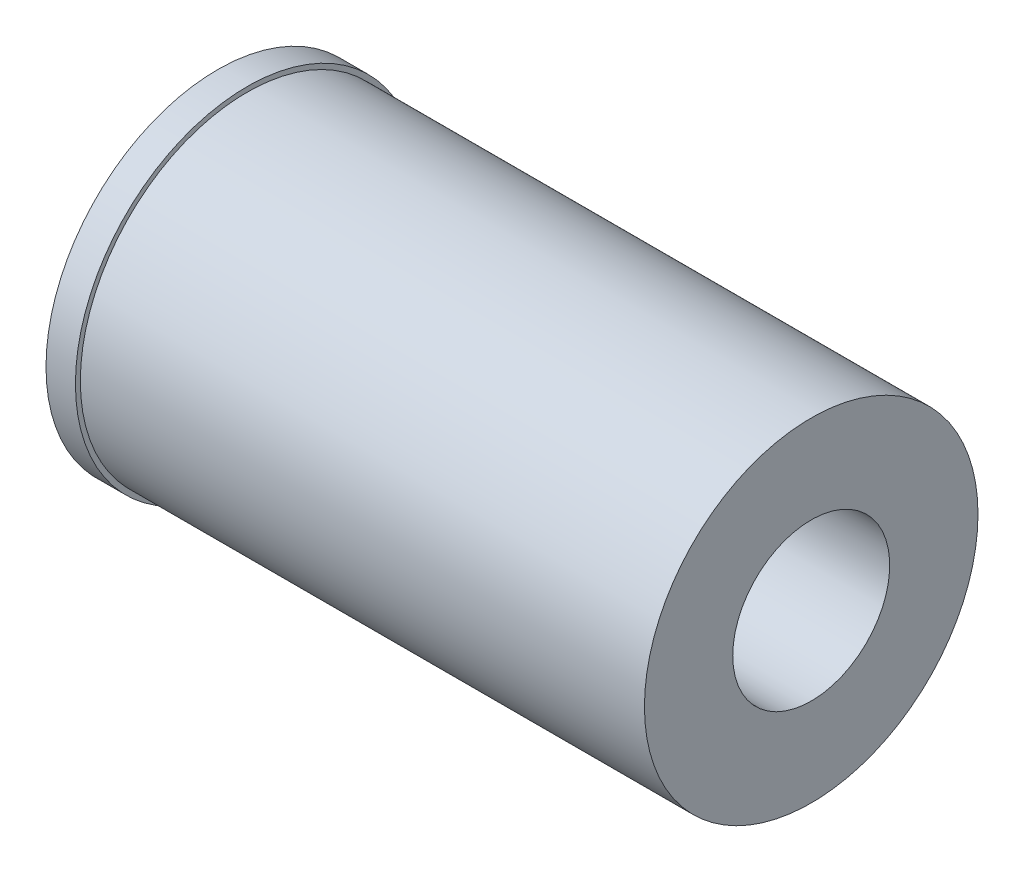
ISO-10303-21;
HEADER;
FILE_DESCRIPTION(('STEP AP214'),'2;1');
FILE_NAME('part.step','',(''),(''),'','','');
FILE_SCHEMA(('AUTOMOTIVE_DESIGN { 1 0 10303 214 1 1 1 1 }'));
ENDSEC;
DATA;
#1=APPLICATION_CONTEXT('core data for automotive mechanical design processes');
#2=APPLICATION_PROTOCOL_DEFINITION('international standard','automotive_design',2000,#1);
#3=PRODUCT_CONTEXT('',#1,'mechanical');
#4=PRODUCT('Part','Part','',(#3));
#5=PRODUCT_RELATED_PRODUCT_CATEGORY('part','',(#4));
#6=PRODUCT_DEFINITION_FORMATION('','',#4);
#7=PRODUCT_DEFINITION_CONTEXT('part definition',#1,'design');
#8=PRODUCT_DEFINITION('design','',#6,#7);
#9=PRODUCT_DEFINITION_SHAPE('','',#8);
#10=(LENGTH_UNIT() NAMED_UNIT(*) SI_UNIT(.MILLI.,.METRE.));
#11=(NAMED_UNIT(*) PLANE_ANGLE_UNIT() SI_UNIT($,.RADIAN.));
#12=(NAMED_UNIT(*) SI_UNIT($,.STERADIAN.) SOLID_ANGLE_UNIT());
#13=UNCERTAINTY_MEASURE_WITH_UNIT(LENGTH_MEASURE(1.E-05),#10,'distance_accuracy_value','');
#14=(GEOMETRIC_REPRESENTATION_CONTEXT(3) GLOBAL_UNCERTAINTY_ASSIGNED_CONTEXT((#13)) GLOBAL_UNIT_ASSIGNED_CONTEXT((#10,
#11,#12)) REPRESENTATION_CONTEXT('',''));
#15=CARTESIAN_POINT('',(0.,0.,0.));
#16=DIRECTION('',(0.,0.,1.));
#17=DIRECTION('',(1.,0.,0.));
#18=AXIS2_PLACEMENT_3D('',#15,#16,#17);
#19=CARTESIAN_POINT('',(0.,0.,0.));
#20=DIRECTION('',(1.,0.,0.));
#21=DIRECTION('',(0.,0.,-1.));
#22=AXIS2_PLACEMENT_3D('',#19,#20,#21);
#23=PLANE('',#22);
#24=CARTESIAN_POINT('',(0.,0.,0.));
#25=DIRECTION('',(-1.,0.,0.));
#26=DIRECTION('',(0.,0.,1.));
#27=AXIS2_PLACEMENT_3D('',#24,#25,#26);
#28=CIRCLE('',#27,3.5);
#29=CARTESIAN_POINT('',(0.,0.,3.5));
#30=VERTEX_POINT('',#29);
#31=EDGE_CURVE('E10',#30,#30,#28,.T.);
#32=ORIENTED_EDGE('',*,*,#31,.T.);
#33=EDGE_LOOP('',(#32));
#34=FACE_BOUND('',#33,.T.);
#35=ADVANCED_FACE('F28',(#34),#23,.F.);
#36=CARTESIAN_POINT('',(0.,0.,0.));
#37=DIRECTION('',(-1.,0.,0.));
#38=DIRECTION('',(0.,0.,1.));
#39=AXIS2_PLACEMENT_3D('',#36,#37,#38);
#40=CYLINDRICAL_SURFACE('',#39,3.5);
#41=ORIENTED_EDGE('',*,*,#31,.F.);
#42=EDGE_LOOP('',(#41));
#43=FACE_BOUND('',#42,.T.);
#44=CARTESIAN_POINT('',(0.6,0.,0.));
#45=DIRECTION('',(-1.,0.,0.));
#46=DIRECTION('',(0.,0.,1.));
#47=AXIS2_PLACEMENT_3D('',#44,#45,#46);
#48=CIRCLE('',#47,3.5);
#49=CARTESIAN_POINT('',(0.6,0.,3.5));
#50=VERTEX_POINT('',#49);
#51=EDGE_CURVE('E34',#50,#50,#48,.T.);
#52=ORIENTED_EDGE('',*,*,#51,.T.);
#53=EDGE_LOOP('',(#52));
#54=FACE_BOUND('',#53,.T.);
#55=ADVANCED_FACE('F72',(#43,#54),#40,.T.);
#56=CARTESIAN_POINT('',(0.6,3.5,0.));
#57=DIRECTION('',(-1.,0.,0.));
#58=DIRECTION('',(0.,0.,1.));
#59=AXIS2_PLACEMENT_3D('',#56,#57,#58);
#60=PLANE('',#59);
#61=ORIENTED_EDGE('',*,*,#51,.F.);
#62=EDGE_LOOP('',(#61));
#63=FACE_BOUND('',#62,.T.);
#64=CARTESIAN_POINT('',(0.6,0.,0.));
#65=DIRECTION('',(-1.,0.,0.));
#66=DIRECTION('',(0.,0.,1.));
#67=AXIS2_PLACEMENT_3D('',#64,#65,#66);
#68=CIRCLE('',#67,3.4);
#69=CARTESIAN_POINT('',(0.6,0.,3.4));
#70=VERTEX_POINT('',#69);
#71=EDGE_CURVE('E38',#70,#70,#68,.T.);
#72=ORIENTED_EDGE('',*,*,#71,.T.);
#73=EDGE_LOOP('',(#72));
#74=FACE_BOUND('',#73,.T.);
#75=ADVANCED_FACE('F76',(#63,#74),#60,.F.);
#76=CARTESIAN_POINT('',(0.,0.,0.));
#77=DIRECTION('',(-1.,0.,0.));
#78=DIRECTION('',(0.,0.,1.));
#79=AXIS2_PLACEMENT_3D('',#76,#77,#78);
#80=CYLINDRICAL_SURFACE('',#79,3.4);
#81=ORIENTED_EDGE('',*,*,#71,.F.);
#82=EDGE_LOOP('',(#81));
#83=FACE_BOUND('',#82,.T.);
#84=CARTESIAN_POINT('',(12.1,0.,0.));
#85=DIRECTION('',(-1.,0.,0.));
#86=DIRECTION('',(0.,0.,1.));
#87=AXIS2_PLACEMENT_3D('',#84,#85,#86);
#88=CIRCLE('',#87,3.4);
#89=CARTESIAN_POINT('',(12.1,0.,3.4));
#90=VERTEX_POINT('',#89);
#91=EDGE_CURVE('E42',#90,#90,#88,.T.);
#92=ORIENTED_EDGE('',*,*,#91,.T.);
#93=EDGE_LOOP('',(#92));
#94=FACE_BOUND('',#93,.T.);
#95=ADVANCED_FACE('F81',(#83,#94),#80,.T.);
#96=CARTESIAN_POINT('',(12.1,3.4,0.));
#97=DIRECTION('',(-1.,0.,0.));
#98=DIRECTION('',(0.,0.,1.));
#99=AXIS2_PLACEMENT_3D('',#96,#97,#98);
#100=PLANE('',#99);
#101=ORIENTED_EDGE('',*,*,#91,.F.);
#102=EDGE_LOOP('',(#101));
#103=FACE_BOUND('',#102,.T.);
#104=CARTESIAN_POINT('',(12.1,0.,0.));
#105=DIRECTION('',(-1.,0.,0.));
#106=DIRECTION('',(0.,0.,1.));
#107=AXIS2_PLACEMENT_3D('',#104,#105,#106);
#108=CIRCLE('',#107,1.6);
#109=CARTESIAN_POINT('',(12.1,0.,1.6));
#110=VERTEX_POINT('',#109);
#111=EDGE_CURVE('E47',#110,#110,#108,.T.);
#112=ORIENTED_EDGE('',*,*,#111,.T.);
#113=EDGE_LOOP('',(#112));
#114=FACE_BOUND('',#113,.T.);
#115=ADVANCED_FACE('F87',(#103,#114),#100,.F.);
#116=CARTESIAN_POINT('',(0.,0.,0.));
#117=DIRECTION('',(-1.,0.,0.));
#118=DIRECTION('',(0.,0.,1.));
#119=AXIS2_PLACEMENT_3D('',#116,#117,#118);
#120=CYLINDRICAL_SURFACE('',#119,1.6);
#121=ORIENTED_EDGE('',*,*,#111,.F.);
#122=EDGE_LOOP('',(#121));
#123=FACE_BOUND('',#122,.T.);
#124=CARTESIAN_POINT('',(1.4,0.,0.));
#125=DIRECTION('',(-1.,0.,0.));
#126=DIRECTION('',(0.,0.,1.));
#127=AXIS2_PLACEMENT_3D('',#124,#125,#126);
#128=CIRCLE('',#127,1.6);
#129=CARTESIAN_POINT('',(1.4,0.,1.6));
#130=VERTEX_POINT('',#129);
#131=EDGE_CURVE('E50',#130,#130,#128,.T.);
#132=ORIENTED_EDGE('',*,*,#131,.T.);
#133=EDGE_LOOP('',(#132));
#134=FACE_BOUND('',#133,.T.);
#135=ADVANCED_FACE('F91',(#123,#134),#120,.F.);
#136=CARTESIAN_POINT('',(1.4,1.6,0.));
#137=DIRECTION('',(-1.,0.,0.));
#138=DIRECTION('',(0.,0.,1.));
#139=AXIS2_PLACEMENT_3D('',#136,#137,#138);
#140=PLANE('',#139);
#141=ORIENTED_EDGE('',*,*,#131,.F.);
#142=EDGE_LOOP('',(#141));
#143=FACE_BOUND('',#142,.T.);
#144=CARTESIAN_POINT('',(1.4,0.,0.));
#145=DIRECTION('',(-1.,0.,0.));
#146=DIRECTION('',(0.,0.,1.));
#147=AXIS2_PLACEMENT_3D('',#144,#145,#146);
#148=CIRCLE('',#147,0.8);
#149=CARTESIAN_POINT('',(1.4,0.,0.8));
#150=VERTEX_POINT('',#149);
#151=EDGE_CURVE('E53',#150,#150,#148,.T.);
#152=ORIENTED_EDGE('',*,*,#151,.T.);
#153=EDGE_LOOP('',(#152));
#154=FACE_BOUND('',#153,.T.);
#155=ADVANCED_FACE('F68',(#143,#154),#140,.F.);
#156=CARTESIAN_POINT('',(0.,0.,0.));
#157=DIRECTION('',(-1.,0.,0.));
#158=DIRECTION('',(0.,0.,1.));
#159=AXIS2_PLACEMENT_3D('',#156,#157,#158);
#160=CYLINDRICAL_SURFACE('',#159,0.8);
#161=ORIENTED_EDGE('',*,*,#151,.F.);
#162=EDGE_LOOP('',(#161));
#163=FACE_BOUND('',#162,.T.);
#164=CARTESIAN_POINT('',(0.6,0.,0.));
#165=DIRECTION('',(-1.,0.,0.));
#166=DIRECTION('',(0.,0.,1.));
#167=AXIS2_PLACEMENT_3D('',#164,#165,#166);
#168=CIRCLE('',#167,0.8);
#169=CARTESIAN_POINT('',(0.6,0.,0.8));
#170=VERTEX_POINT('',#169);
#171=EDGE_CURVE('E56',#170,#170,#168,.T.);
#172=ORIENTED_EDGE('',*,*,#171,.T.);
#173=EDGE_LOOP('',(#172));
#174=FACE_BOUND('',#173,.T.);
#175=ADVANCED_FACE('F60',(#163,#174),#160,.F.);
#176=CARTESIAN_POINT('',(0.6,0.8,0.));
#177=DIRECTION('',(-1.,0.,0.));
#178=DIRECTION('',(0.,0.,1.));
#179=AXIS2_PLACEMENT_3D('',#176,#177,#178);
#180=PLANE('',#179);
#181=ORIENTED_EDGE('',*,*,#171,.F.);
#182=EDGE_LOOP('',(#181));
#183=FACE_BOUND('',#182,.T.);
#184=ADVANCED_FACE('F62',(#183),#180,.F.);
#185=CLOSED_SHELL('',(#35,#55,#75,#95,#115,#135,#155,#175,#184));
#186=MANIFOLD_SOLID_BREP('B2',#185);
#187=ADVANCED_BREP_SHAPE_REPRESENTATION('',(#18,#186),#14);
#188=SHAPE_DEFINITION_REPRESENTATION(#9,#187);
ENDSEC;
END-ISO-10303-21;
